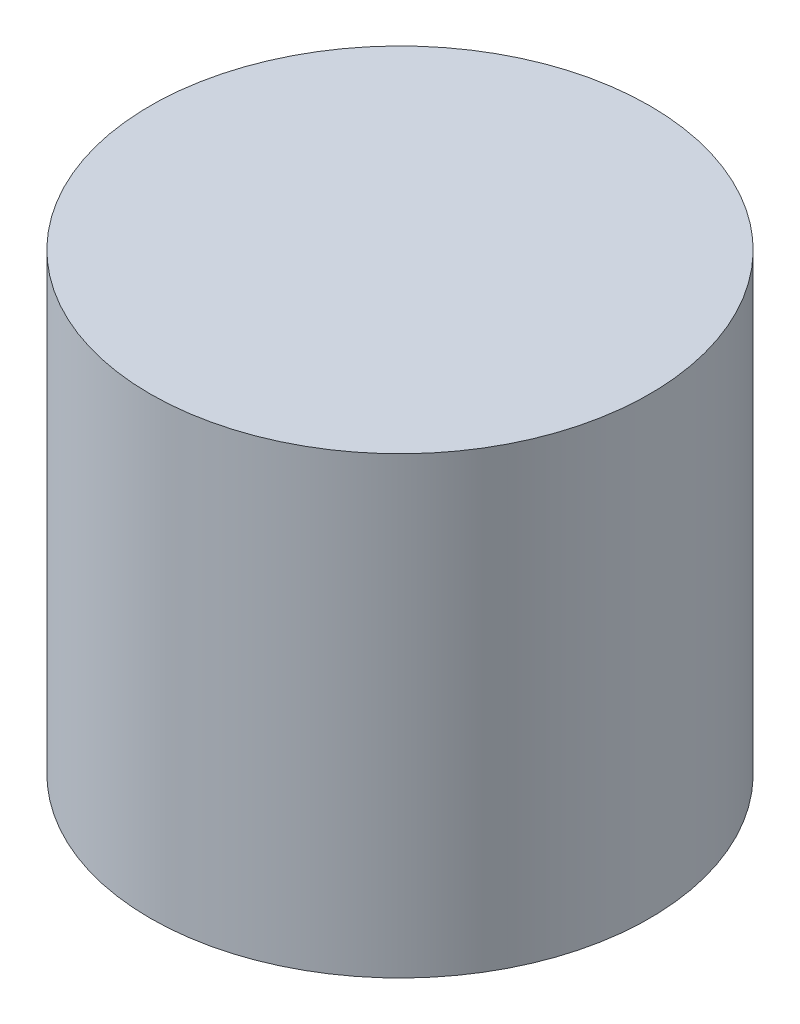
from build123d import *

# Parameters (mm, degrees)
SKETCH1_R           = 22
BOSS_EXTRUDE1_DEPTH = 40


with BuildPart() as part:
    # Sketch1 → Boss-Extrude1 (new body)
    with BuildSketch(Plane(origin=(0, 0, 0), x_dir=(1, 0, 0), z_dir=(0, 1, 0))):
        with Locations(Location((0, 0, 0), (0, 0, 270))):
            Circle(SKETCH1_R)
    extrude(amount=BOSS_EXTRUDE1_DEPTH)


solid = part.part
